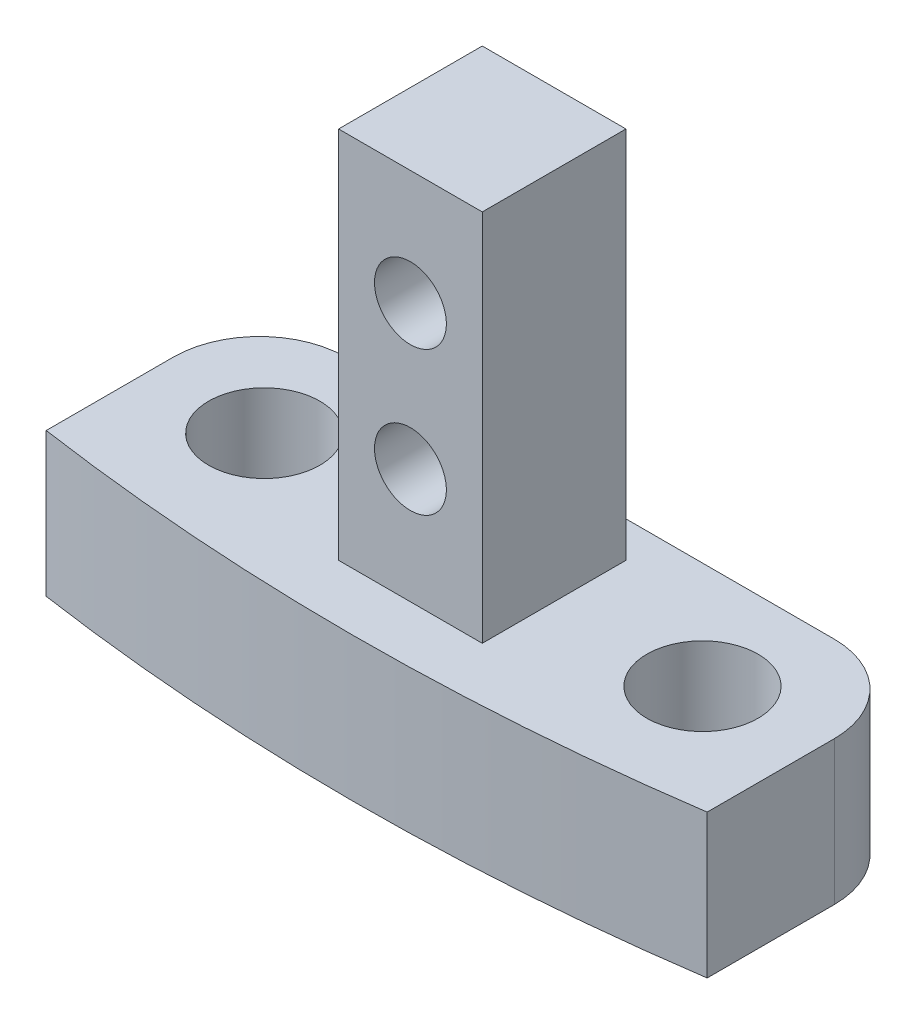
from build123d import *

# Parameters (mm, degrees)
BOSS_EXTRUDE1_DEPTH          = 6.35
SKETCH2_W                    = 6.35
SKETCH2_H                    = 6.35
BOSS_EXTRUDE2_DEPTH          = 16.51
F_10_0_1935_DIAMETER_HOLE1_D = 4.9149
F_1_8_0_125_DIAMETER_HOLE1_D = 3.175
FILLET1_R                    = 3.81


with BuildPart() as part:
    # Sketch1 → Boss-Extrude1 (new body)
    with BuildSketch(Plane(origin=(0, 0, 0), x_dir=(1, 0, 0), z_dir=(0, 1, 0))):
        with BuildLine():
            Line((-14.605, -20.781392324), (-14.605, -11.352978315))
            Line((-14.605, -11.352978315), (14.605, -11.352978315))
            Line((14.605, -11.352978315), (14.605, -20.781392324))
            ThreePointArc((14.605, -20.781392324), (0, -21.843178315), (-14.605, -20.781392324))
        make_face()
    extrude(amount=BOSS_EXTRUDE1_DEPTH)

    # Sketch2 → Boss-Extrude2 (add)
    with BuildSketch(Plane(origin=(0, 6.35, 0), x_dir=(1, 0, 0), z_dir=(0, 1, 0))):
        with Locations((0, -16.115478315)):
            Rectangle(SKETCH2_W, SKETCH2_H)
    extrude(amount=BOSS_EXTRUDE2_DEPTH)

    # 10 _0.1935_ Diameter Hole1 (through all)
    with Locations(Plane(origin=(0, 6.35, 0), x_dir=(1, 0, 0), z_dir=(0, 1, 0))):
        with Locations((9.68375, -16.06718532), (-9.68375, -16.06718532)):
            Hole(F_10_0_1935_DIAMETER_HOLE1_D / 2)

    # 1_8 _0.125_ Diameter Hole1 (through all)
    with Locations(Plane(origin=(0, 0, 12.940478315), x_dir=(-1, 0, 0), z_dir=(0, 0, -1))):
        with Locations((0, 17.78), (0, 11.43)):
            Hole(F_1_8_0_125_DIAMETER_HOLE1_D / 2)

    # Fillet1
    fillet1_edges = [part.edges().sort_by_distance(p)[0] for p in [
        (-14.605, 3.175, 11.352978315),
        (14.605, 3.175, 11.352978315),
    ]]
    fillet(fillet1_edges, radius=FILLET1_R)


solid = part.part
